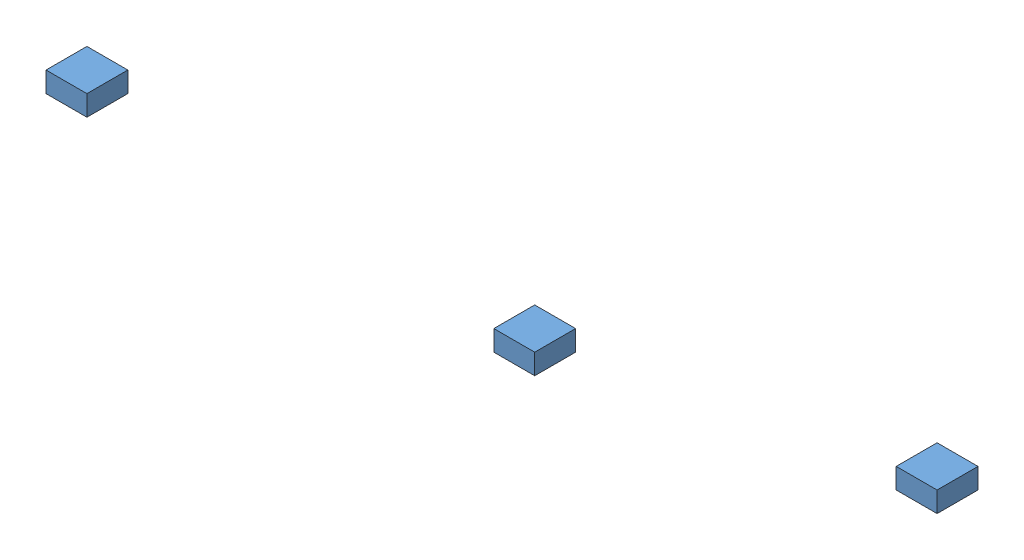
SolidWorks assembly LimitVerknuepfungen01.SLDASM, configuration Standard (file format 5000). Lengths in mm.
Overall size (3100 50 300).
3 component instances, 1 part files, 7 mates.
Components (placement in the parent):
- Klotz-1: Klotz.SLDPRT [Standard] at origin size (100 50 100)
- Klotz-2: Klotz.SLDPRT [Standard] at (1878.1009 0 -200) size (100 50 100)
- Klotz-3: Klotz.SLDPRT [Standard] at (1094.568 0 0) size (100 50 100)
Mates (geometry in assembly coordinates):
- Deckungsgleich1: coincident anti-aligned: plane of Klotz-2 through (1878.1009 0 -200) normal (0 -1 0); plane of assembly through (0 0 0) normal (0 1 0)
- Deckungsgleich2: coincident anti-aligned: plane of Klotz-3 through (1094.568 0 0) normal (0 -1 0); plane of assembly through (0 0 0) normal (0 1 0)
- Deckungsgleich3: coincident: plane of Klotz-2 through (1778.1009 50 -200) normal (0 0 1); line of assembly
- Deckungsgleich4: coincident: plane of Klotz-3 through (994.568 50 0) normal (0 0 1); line of assembly
- Deckungsgleich5: coincident: point of Klotz-2; curve of assembly
- Deckungsgleich6: coincident: point of Klotz-3; curve of assembly
- LimitAbstand1: limit distance = 683.5329 mm anti-aligned: plane of Klotz-3 through (1094.568 50 0) normal (1 0 0); plane of Klotz-2 through (1778.1009 50 -200) normal (-1 0 0)
